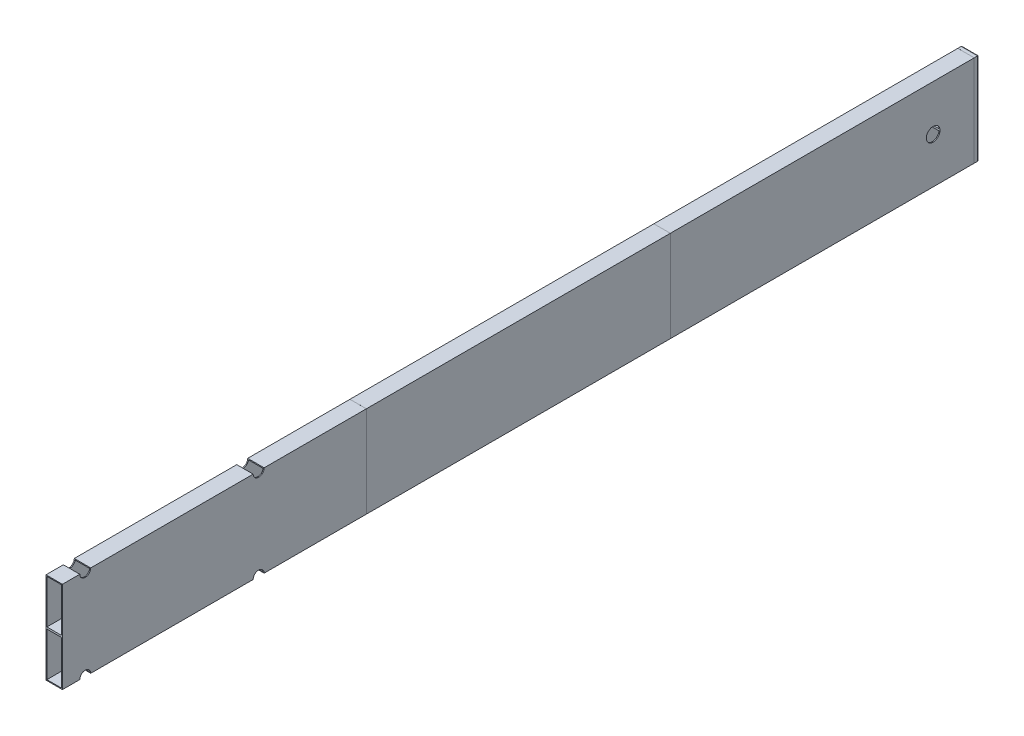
ISO-10303-21;
HEADER;
FILE_DESCRIPTION(('STEP AP214'),'2;1');
FILE_NAME('part.step','',(''),(''),'','','');
FILE_SCHEMA(('AUTOMOTIVE_DESIGN { 1 0 10303 214 1 1 1 1 }'));
ENDSEC;
DATA;
#1=APPLICATION_CONTEXT('core data for automotive mechanical design processes');
#2=APPLICATION_PROTOCOL_DEFINITION('international standard','automotive_design',2000,#1);
#3=PRODUCT_CONTEXT('',#1,'mechanical');
#4=PRODUCT('Part','Part','',(#3));
#5=PRODUCT_RELATED_PRODUCT_CATEGORY('part','',(#4));
#6=PRODUCT_DEFINITION_FORMATION('','',#4);
#7=PRODUCT_DEFINITION_CONTEXT('part definition',#1,'design');
#8=PRODUCT_DEFINITION('design','',#6,#7);
#9=PRODUCT_DEFINITION_SHAPE('','',#8);
#10=(LENGTH_UNIT() NAMED_UNIT(*) SI_UNIT(.MILLI.,.METRE.));
#11=(NAMED_UNIT(*) PLANE_ANGLE_UNIT() SI_UNIT($,.RADIAN.));
#12=(NAMED_UNIT(*) SI_UNIT($,.STERADIAN.) SOLID_ANGLE_UNIT());
#13=UNCERTAINTY_MEASURE_WITH_UNIT(LENGTH_MEASURE(1.E-05),#10,'distance_accuracy_value','');
#14=(GEOMETRIC_REPRESENTATION_CONTEXT(3) GLOBAL_UNCERTAINTY_ASSIGNED_CONTEXT((#13)) GLOBAL_UNIT_ASSIGNED_CONTEXT((#10,
#11,#12)) REPRESENTATION_CONTEXT('',''));
#15=CARTESIAN_POINT('',(0.,0.,0.));
#16=DIRECTION('',(0.,0.,1.));
#17=DIRECTION('',(1.,0.,0.));
#18=AXIS2_PLACEMENT_3D('',#15,#16,#17);
#19=CARTESIAN_POINT('',(-8.00000000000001,51.,-333.));
#20=DIRECTION('',(0.,-1.,0.));
#21=DIRECTION('',(0.,0.,-1.));
#22=AXIS2_PLACEMENT_3D('',#19,#20,#21);
#23=PLANE('',#22);
#24=DIRECTION('',(0.,0.,1.));
#25=VECTOR('',#24,1.);
#26=CARTESIAN_POINT('',(-8.00000000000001,51.,-333.));
#27=LINE('',#26,#25);
#28=CARTESIAN_POINT('',(-8.,51.,-999.));
#29=VERTEX_POINT('',#28);
#30=CARTESIAN_POINT('',(-8.00000000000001,51.,-961.433034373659));
#31=VERTEX_POINT('',#30);
#32=EDGE_CURVE('E399',#29,#31,#27,.T.);
#33=ORIENTED_EDGE('',*,*,#32,.T.);
#34=DIRECTION('',(1.,0.,0.));
#35=VECTOR('',#34,1.);
#36=CARTESIAN_POINT('',(-9.01000000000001,51.,-961.433034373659));
#37=LINE('',#36,#35);
#38=CARTESIAN_POINT('',(8.00000000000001,51.,-961.433034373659));
#39=VERTEX_POINT('',#38);
#40=EDGE_CURVE('E508',#31,#39,#37,.T.);
#41=ORIENTED_EDGE('',*,*,#40,.T.);
#42=DIRECTION('',(0.,0.,1.));
#43=VECTOR('',#42,1.);
#44=CARTESIAN_POINT('',(8.00000000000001,51.,-333.));
#45=LINE('',#44,#43);
#46=CARTESIAN_POINT('',(8.,51.,-999.));
#47=VERTEX_POINT('',#46);
#48=EDGE_CURVE('E394',#47,#39,#45,.T.);
#49=ORIENTED_EDGE('',*,*,#48,.F.);
#50=DIRECTION('',(-1.,0.,0.));
#51=VECTOR('',#50,1.);
#52=CARTESIAN_POINT('',(8.,51.,-999.));
#53=LINE('',#52,#51);
#54=EDGE_CURVE('E548',#47,#29,#53,.T.);
#55=ORIENTED_EDGE('',*,*,#54,.T.);
#56=EDGE_LOOP('',(#33,#41,#49,#55));
#57=FACE_BOUND('',#56,.T.);
#58=ADVANCED_FACE('F39',(#57),#23,.F.);
#59=CARTESIAN_POINT('',(-8.00000000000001,49.,-333.));
#60=DIRECTION('',(0.,1.,0.));
#61=DIRECTION('',(0.,0.,1.));
#62=AXIS2_PLACEMENT_3D('',#59,#60,#61);
#63=PLANE('',#62);
#64=DIRECTION('',(0.,0.,1.));
#65=VECTOR('',#64,1.);
#66=CARTESIAN_POINT('',(-8.00000000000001,49.,-333.));
#67=LINE('',#66,#65);
#68=CARTESIAN_POINT('',(-8.00000000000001,49.,-946.566965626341));
#69=VERTEX_POINT('',#68);
#70=CARTESIAN_POINT('',(-8.00000000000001,49.,0.));
#71=VERTEX_POINT('',#70);
#72=EDGE_CURVE('E347',#69,#71,#67,.T.);
#73=ORIENTED_EDGE('',*,*,#72,.F.);
#74=DIRECTION('',(1.,0.,0.));
#75=VECTOR('',#74,1.);
#76=CARTESIAN_POINT('',(-9.01000000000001,49.,-946.566965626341));
#77=LINE('',#76,#75);
#78=CARTESIAN_POINT('',(8.00000000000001,49.,-946.566965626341));
#79=VERTEX_POINT('',#78);
#80=EDGE_CURVE('E334',#69,#79,#77,.T.);
#81=ORIENTED_EDGE('',*,*,#80,.T.);
#82=DIRECTION('',(0.,0.,1.));
#83=VECTOR('',#82,1.);
#84=CARTESIAN_POINT('',(8.00000000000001,49.,-333.));
#85=LINE('',#84,#83);
#86=CARTESIAN_POINT('',(8.00000000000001,49.,0.));
#87=VERTEX_POINT('',#86);
#88=EDGE_CURVE('E345',#79,#87,#85,.T.);
#89=ORIENTED_EDGE('',*,*,#88,.T.);
#90=DIRECTION('',(-1.,0.,0.));
#91=VECTOR('',#90,1.);
#92=CARTESIAN_POINT('',(-8.00000000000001,49.,0.));
#93=LINE('',#92,#91);
#94=EDGE_CURVE('E697',#87,#71,#93,.T.);
#95=ORIENTED_EDGE('',*,*,#94,.T.);
#96=EDGE_LOOP('',(#73,#81,#89,#95));
#97=FACE_BOUND('',#96,.T.);
#98=ADVANCED_FACE('F343',(#97),#63,.F.);
#99=CARTESIAN_POINT('',(9.01,-0.00999999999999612,-666.));
#100=DIRECTION('',(0.,0.,-1.));
#101=DIRECTION('',(-1.,0.,0.));
#102=AXIS2_PLACEMENT_3D('',#99,#100,#101);
#103=PLANE('',#102);
#104=DIRECTION('',(0.,-1.,0.));
#105=VECTOR('',#104,1.);
#106=CARTESIAN_POINT('',(9.01,100.01,-666.));
#107=LINE('',#106,#105);
#108=CARTESIAN_POINT('',(9.01,100.01,-666.));
#109=VERTEX_POINT('',#108);
#110=CARTESIAN_POINT('',(9.01,-0.00999999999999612,-666.));
#111=VERTEX_POINT('',#110);
#112=EDGE_CURVE('E598',#109,#111,#107,.T.);
#113=ORIENTED_EDGE('',*,*,#112,.T.);
#114=DIRECTION('',(-1.,0.,0.));
#115=VECTOR('',#114,1.);
#116=CARTESIAN_POINT('',(9.01,-0.00999999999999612,-666.));
#117=LINE('',#116,#115);
#118=CARTESIAN_POINT('',(-9.01,-0.00999999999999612,-666.));
#119=VERTEX_POINT('',#118);
#120=EDGE_CURVE('E601',#111,#119,#117,.T.);
#121=ORIENTED_EDGE('',*,*,#120,.T.);
#122=DIRECTION('',(0.,1.,0.));
#123=VECTOR('',#122,1.);
#124=CARTESIAN_POINT('',(-9.01,100.01,-666.));
#125=LINE('',#124,#123);
#126=CARTESIAN_POINT('',(-9.01,100.01,-666.));
#127=VERTEX_POINT('',#126);
#128=EDGE_CURVE('E603',#119,#127,#125,.T.);
#129=ORIENTED_EDGE('',*,*,#128,.T.);
#130=DIRECTION('',(1.,0.,0.));
#131=VECTOR('',#130,1.);
#132=CARTESIAN_POINT('',(9.01,100.01,-666.));
#133=LINE('',#132,#131);
#134=EDGE_CURVE('E605',#127,#109,#133,.T.);
#135=ORIENTED_EDGE('',*,*,#134,.T.);
#136=EDGE_LOOP('',(#113,#121,#129,#135));
#137=FACE_BOUND('',#136,.T.);
#138=DIRECTION('',(-1.,0.,0.));
#139=VECTOR('',#138,1.);
#140=CARTESIAN_POINT('',(9.,0.,-666.));
#141=LINE('',#140,#139);
#142=CARTESIAN_POINT('',(9.,0.,-666.));
#143=VERTEX_POINT('',#142);
#144=CARTESIAN_POINT('',(-9.,0.,-666.));
#145=VERTEX_POINT('',#144);
#146=EDGE_CURVE('E560',#143,#145,#141,.T.);
#147=ORIENTED_EDGE('',*,*,#146,.F.);
#148=DIRECTION('',(0.,-1.,0.));
#149=VECTOR('',#148,1.);
#150=CARTESIAN_POINT('',(9.,100.,-666.));
#151=LINE('',#150,#149);
#152=CARTESIAN_POINT('',(9.,100.,-666.));
#153=VERTEX_POINT('',#152);
#154=EDGE_CURVE('E557',#153,#143,#151,.T.);
#155=ORIENTED_EDGE('',*,*,#154,.F.);
#156=DIRECTION('',(1.,0.,0.));
#157=VECTOR('',#156,1.);
#158=CARTESIAN_POINT('',(9.,100.,-666.));
#159=LINE('',#158,#157);
#160=CARTESIAN_POINT('',(-9.,100.,-666.));
#161=VERTEX_POINT('',#160);
#162=EDGE_CURVE('E565',#161,#153,#159,.T.);
#163=ORIENTED_EDGE('',*,*,#162,.F.);
#164=DIRECTION('',(0.,1.,0.));
#165=VECTOR('',#164,1.);
#166=CARTESIAN_POINT('',(-9.,100.,-666.));
#167=LINE('',#166,#165);
#168=EDGE_CURVE('E562',#145,#161,#167,.T.);
#169=ORIENTED_EDGE('',*,*,#168,.F.);
#170=EDGE_LOOP('',(#147,#155,#163,#169));
#171=FACE_BOUND('',#170,.T.);
#172=ADVANCED_FACE('F793',(#137,#171),#103,.T.);
#173=CARTESIAN_POINT('',(-9.,0.,-333.));
#174=DIRECTION('',(0.,-1.,0.));
#175=DIRECTION('',(0.,0.,-1.));
#176=AXIS2_PLACEMENT_3D('',#173,#174,#175);
#177=PLANE('',#176);
#178=DIRECTION('',(1.,0.,0.));
#179=VECTOR('',#178,1.);
#180=CARTESIAN_POINT('',(-9.00000000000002,0.,-221.));
#181=LINE('',#180,#179);
#182=CARTESIAN_POINT('',(-9.00000000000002,0.,-221.));
#183=VERTEX_POINT('',#182);
#184=CARTESIAN_POINT('',(9.,0.,-221.));
#185=VERTEX_POINT('',#184);
#186=EDGE_CURVE('E635',#183,#185,#181,.T.);
#187=ORIENTED_EDGE('',*,*,#186,.F.);
#188=DIRECTION('',(0.,0.,1.));
#189=VECTOR('',#188,1.);
#190=CARTESIAN_POINT('',(-9.,0.,-333.));
#191=LINE('',#190,#189);
#192=CARTESIAN_POINT('',(-9.,0.,-333.));
#193=VERTEX_POINT('',#192);
#194=EDGE_CURVE('E442',#193,#183,#191,.T.);
#195=ORIENTED_EDGE('',*,*,#194,.F.);
#196=DIRECTION('',(1.,0.,0.));
#197=VECTOR('',#196,1.);
#198=CARTESIAN_POINT('',(-9.,0.,-333.));
#199=LINE('',#198,#197);
#200=CARTESIAN_POINT('',(9.,0.,-333.));
#201=VERTEX_POINT('',#200);
#202=EDGE_CURVE('E416',#193,#201,#199,.T.);
#203=ORIENTED_EDGE('',*,*,#202,.T.);
#204=DIRECTION('',(0.,0.,1.));
#205=VECTOR('',#204,1.);
#206=CARTESIAN_POINT('',(9.,0.,-333.));
#207=LINE('',#206,#205);
#208=EDGE_CURVE('E437',#201,#185,#207,.T.);
#209=ORIENTED_EDGE('',*,*,#208,.T.);
#210=EDGE_LOOP('',(#187,#195,#203,#209));
#211=FACE_BOUND('',#210,.T.);
#212=ADVANCED_FACE('F865',(#211),#177,.T.);
#213=CARTESIAN_POINT('',(-8.,1.,-333.));
#214=DIRECTION('',(0.,-1.,0.));
#215=DIRECTION('',(0.,0.,-1.));
#216=AXIS2_PLACEMENT_3D('',#213,#214,#215);
#217=PLANE('',#216);
#218=DIRECTION('',(0.,0.,1.));
#219=VECTOR('',#218,1.);
#220=CARTESIAN_POINT('',(-8.,1.,-333.));
#221=LINE('',#220,#219);
#222=CARTESIAN_POINT('',(-8.,1.,-999.));
#223=VERTEX_POINT('',#222);
#224=CARTESIAN_POINT('',(-8.,1.,-220.9160797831));
#225=VERTEX_POINT('',#224);
#226=EDGE_CURVE('E365',#223,#225,#221,.T.);
#227=ORIENTED_EDGE('',*,*,#226,.T.);
#228=DIRECTION('',(1.,0.,0.));
#229=VECTOR('',#228,1.);
#230=CARTESIAN_POINT('',(-9.00000000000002,1.,-220.9160797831));
#231=LINE('',#230,#229);
#232=CARTESIAN_POINT('',(8.,1.,-220.9160797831));
#233=VERTEX_POINT('',#232);
#234=EDGE_CURVE('E627',#225,#233,#231,.T.);
#235=ORIENTED_EDGE('',*,*,#234,.T.);
#236=DIRECTION('',(0.,0.,1.));
#237=VECTOR('',#236,1.);
#238=CARTESIAN_POINT('',(8.,1.,-333.));
#239=LINE('',#238,#237);
#240=CARTESIAN_POINT('',(8.,1.,-999.));
#241=VERTEX_POINT('',#240);
#242=EDGE_CURVE('E355',#241,#233,#239,.T.);
#243=ORIENTED_EDGE('',*,*,#242,.F.);
#244=DIRECTION('',(-1.,0.,0.));
#245=VECTOR('',#244,1.);
#246=CARTESIAN_POINT('',(8.,1.,-999.));
#247=LINE('',#246,#245);
#248=EDGE_CURVE('E536',#241,#223,#247,.T.);
#249=ORIENTED_EDGE('',*,*,#248,.T.);
#250=EDGE_LOOP('',(#227,#235,#243,#249));
#251=FACE_BOUND('',#250,.T.);
#252=ADVANCED_FACE('F722',(#251),#217,.F.);
#253=DIRECTION('',(1.,0.,0.));
#254=VECTOR('',#253,1.);
#255=CARTESIAN_POINT('',(-9.00000000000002,0.,-209.));
#256=LINE('',#255,#254);
#257=CARTESIAN_POINT('',(9.,0.,-209.));
#258=VERTEX_POINT('',#257);
#259=CARTESIAN_POINT('',(-9.00000000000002,0.,-209.));
#260=VERTEX_POINT('',#259);
#261=EDGE_CURVE('E633',#258,#260,#256,.F.);
#262=ORIENTED_EDGE('',*,*,#261,.F.);
#263=CARTESIAN_POINT('',(9.,0.,-31.));
#264=VERTEX_POINT('',#263);
#265=EDGE_CURVE('E440',#258,#264,#207,.T.);
#266=ORIENTED_EDGE('',*,*,#265,.T.);
#267=DIRECTION('',(1.,0.,0.));
#268=VECTOR('',#267,1.);
#269=CARTESIAN_POINT('',(-9.00000000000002,0.,-31.));
#270=LINE('',#269,#268);
#271=CARTESIAN_POINT('',(-9.00000000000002,0.,-31.));
#272=VERTEX_POINT('',#271);
#273=EDGE_CURVE('E650',#272,#264,#270,.T.);
#274=ORIENTED_EDGE('',*,*,#273,.F.);
#275=EDGE_CURVE('E445',#260,#272,#191,.T.);
#276=ORIENTED_EDGE('',*,*,#275,.F.);
#277=EDGE_LOOP('',(#262,#266,#274,#276));
#278=FACE_BOUND('',#277,.T.);
#279=ADVANCED_FACE('F900',(#278),#177,.T.);
#280=CARTESIAN_POINT('',(8.,1.,-209.0839202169));
#281=VERTEX_POINT('',#280);
#282=CARTESIAN_POINT('',(8.,1.,-30.9160797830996));
#283=VERTEX_POINT('',#282);
#284=EDGE_CURVE('E358',#281,#283,#239,.T.);
#285=ORIENTED_EDGE('',*,*,#284,.F.);
#286=DIRECTION('',(1.,0.,0.));
#287=VECTOR('',#286,1.);
#288=CARTESIAN_POINT('',(-9.00000000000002,1.,-209.0839202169));
#289=LINE('',#288,#287);
#290=CARTESIAN_POINT('',(-8.,1.,-209.0839202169));
#291=VERTEX_POINT('',#290);
#292=EDGE_CURVE('E624',#281,#291,#289,.F.);
#293=ORIENTED_EDGE('',*,*,#292,.T.);
#294=CARTESIAN_POINT('',(-8.,1.,-30.9160797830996));
#295=VERTEX_POINT('',#294);
#296=EDGE_CURVE('E368',#291,#295,#221,.T.);
#297=ORIENTED_EDGE('',*,*,#296,.T.);
#298=DIRECTION('',(1.,0.,0.));
#299=VECTOR('',#298,1.);
#300=CARTESIAN_POINT('',(-9.00000000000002,1.,-30.9160797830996));
#301=LINE('',#300,#299);
#302=EDGE_CURVE('E454',#295,#283,#301,.T.);
#303=ORIENTED_EDGE('',*,*,#302,.T.);
#304=EDGE_LOOP('',(#285,#293,#297,#303));
#305=FACE_BOUND('',#304,.T.);
#306=ADVANCED_FACE('F705',(#305),#217,.F.);
#307=CARTESIAN_POINT('',(-9.00000000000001,100.,-333.));
#308=DIRECTION('',(0.,1.,0.));
#309=DIRECTION('',(0.,0.,1.));
#310=AXIS2_PLACEMENT_3D('',#307,#308,#309);
#311=PLANE('',#310);
#312=DIRECTION('',(1.,0.,0.));
#313=VECTOR('',#312,1.);
#314=CARTESIAN_POINT('',(-9.00000000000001,100.,-209.));
#315=LINE('',#314,#313);
#316=CARTESIAN_POINT('',(-9.00000000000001,100.,-209.));
#317=VERTEX_POINT('',#316);
#318=CARTESIAN_POINT('',(9.00000000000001,100.,-209.));
#319=VERTEX_POINT('',#318);
#320=EDGE_CURVE('E669',#317,#319,#315,.T.);
#321=ORIENTED_EDGE('',*,*,#320,.F.);
#322=DIRECTION('',(0.,0.,1.));
#323=VECTOR('',#322,1.);
#324=CARTESIAN_POINT('',(-9.00000000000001,100.,-333.));
#325=LINE('',#324,#323);
#326=CARTESIAN_POINT('',(-9.00000000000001,100.,-31.));
#327=VERTEX_POINT('',#326);
#328=EDGE_CURVE('E430',#317,#327,#325,.T.);
#329=ORIENTED_EDGE('',*,*,#328,.T.);
#330=DIRECTION('',(1.,0.,0.));
#331=VECTOR('',#330,1.);
#332=CARTESIAN_POINT('',(-9.00000000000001,100.,-31.));
#333=LINE('',#332,#331);
#334=CARTESIAN_POINT('',(9.00000000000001,100.,-31.));
#335=VERTEX_POINT('',#334);
#336=EDGE_CURVE('E686',#335,#327,#333,.F.);
#337=ORIENTED_EDGE('',*,*,#336,.F.);
#338=DIRECTION('',(0.,0.,1.));
#339=VECTOR('',#338,1.);
#340=CARTESIAN_POINT('',(9.00000000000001,100.,-333.));
#341=LINE('',#340,#339);
#342=EDGE_CURVE('E435',#319,#335,#341,.T.);
#343=ORIENTED_EDGE('',*,*,#342,.F.);
#344=EDGE_LOOP('',(#321,#329,#337,#343));
#345=FACE_BOUND('',#344,.T.);
#346=ADVANCED_FACE('F773',(#345),#311,.T.);
#347=CARTESIAN_POINT('',(-8.,99.,-333.));
#348=DIRECTION('',(0.,1.,0.));
#349=DIRECTION('',(0.,0.,1.));
#350=AXIS2_PLACEMENT_3D('',#347,#348,#349);
#351=PLANE('',#350);
#352=DIRECTION('',(0.,0.,1.));
#353=VECTOR('',#352,1.);
#354=CARTESIAN_POINT('',(-8.,99.,-333.));
#355=LINE('',#354,#353);
#356=CARTESIAN_POINT('',(-8.,99.,-209.0839202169));
#357=VERTEX_POINT('',#356);
#358=CARTESIAN_POINT('',(-8.,99.,-30.9160797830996));
#359=VERTEX_POINT('',#358);
#360=EDGE_CURVE('E387',#357,#359,#355,.T.);
#361=ORIENTED_EDGE('',*,*,#360,.F.);
#362=DIRECTION('',(1.,0.,0.));
#363=VECTOR('',#362,1.);
#364=CARTESIAN_POINT('',(-9.00000000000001,99.,-209.0839202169));
#365=LINE('',#364,#363);
#366=CARTESIAN_POINT('',(8.,99.,-209.0839202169));
#367=VERTEX_POINT('',#366);
#368=EDGE_CURVE('E661',#357,#367,#365,.T.);
#369=ORIENTED_EDGE('',*,*,#368,.T.);
#370=DIRECTION('',(0.,0.,1.));
#371=VECTOR('',#370,1.);
#372=CARTESIAN_POINT('',(8.,99.,-333.));
#373=LINE('',#372,#371);
#374=CARTESIAN_POINT('',(8.,99.,-30.9160797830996));
#375=VERTEX_POINT('',#374);
#376=EDGE_CURVE('E392',#367,#375,#373,.T.);
#377=ORIENTED_EDGE('',*,*,#376,.T.);
#378=DIRECTION('',(1.,0.,0.));
#379=VECTOR('',#378,1.);
#380=CARTESIAN_POINT('',(-9.00000000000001,99.,-30.9160797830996));
#381=LINE('',#380,#379);
#382=EDGE_CURVE('E677',#375,#359,#381,.F.);
#383=ORIENTED_EDGE('',*,*,#382,.T.);
#384=EDGE_LOOP('',(#361,#369,#377,#383));
#385=FACE_BOUND('',#384,.T.);
#386=ADVANCED_FACE('F770',(#385),#351,.F.);
#387=DIRECTION('',(1.,0.,0.));
#388=VECTOR('',#387,1.);
#389=CARTESIAN_POINT('',(-9.00000000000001,100.,-19.));
#390=LINE('',#389,#388);
#391=CARTESIAN_POINT('',(-9.00000000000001,100.,-19.));
#392=VERTEX_POINT('',#391);
#393=CARTESIAN_POINT('',(9.00000000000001,100.,-19.));
#394=VERTEX_POINT('',#393);
#395=EDGE_CURVE('E689',#392,#394,#390,.T.);
#396=ORIENTED_EDGE('',*,*,#395,.F.);
#397=CARTESIAN_POINT('',(-9.00000000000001,100.,0.));
#398=VERTEX_POINT('',#397);
#399=EDGE_CURVE('E431',#392,#398,#325,.T.);
#400=ORIENTED_EDGE('',*,*,#399,.T.);
#401=DIRECTION('',(-1.,0.,0.));
#402=VECTOR('',#401,1.);
#403=CARTESIAN_POINT('',(-9.00000000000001,100.,0.));
#404=LINE('',#403,#402);
#405=CARTESIAN_POINT('',(9.00000000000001,100.,0.));
#406=VERTEX_POINT('',#405);
#407=EDGE_CURVE('E410',#406,#398,#404,.T.);
#408=ORIENTED_EDGE('',*,*,#407,.F.);
#409=EDGE_CURVE('E436',#394,#406,#341,.T.);
#410=ORIENTED_EDGE('',*,*,#409,.F.);
#411=EDGE_LOOP('',(#396,#400,#408,#410));
#412=FACE_BOUND('',#411,.T.);
#413=ADVANCED_FACE('F772',(#412),#311,.T.);
#414=CARTESIAN_POINT('',(-8.,99.,-19.0839202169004));
#415=VERTEX_POINT('',#414);
#416=CARTESIAN_POINT('',(-8.,99.,0.));
#417=VERTEX_POINT('',#416);
#418=EDGE_CURVE('E388',#415,#417,#355,.T.);
#419=ORIENTED_EDGE('',*,*,#418,.F.);
#420=DIRECTION('',(1.,0.,0.));
#421=VECTOR('',#420,1.);
#422=CARTESIAN_POINT('',(-9.00000000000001,99.,-19.0839202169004));
#423=LINE('',#422,#421);
#424=CARTESIAN_POINT('',(8.,99.,-19.0839202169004));
#425=VERTEX_POINT('',#424);
#426=EDGE_CURVE('E680',#415,#425,#423,.T.);
#427=ORIENTED_EDGE('',*,*,#426,.T.);
#428=CARTESIAN_POINT('',(8.,99.,0.));
#429=VERTEX_POINT('',#428);
#430=EDGE_CURVE('E393',#425,#429,#373,.T.);
#431=ORIENTED_EDGE('',*,*,#430,.T.);
#432=DIRECTION('',(-1.,0.,0.));
#433=VECTOR('',#432,1.);
#434=CARTESIAN_POINT('',(-8.,99.,0.));
#435=LINE('',#434,#433);
#436=EDGE_CURVE('E379',#429,#417,#435,.T.);
#437=ORIENTED_EDGE('',*,*,#436,.T.);
#438=EDGE_LOOP('',(#419,#427,#431,#437));
#439=FACE_BOUND('',#438,.T.);
#440=ADVANCED_FACE('F760',(#439),#351,.F.);
#441=CARTESIAN_POINT('',(-9.00000000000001,100.,-333.));
#442=DIRECTION('',(-1.,0.,0.));
#443=DIRECTION('',(0.,-1.,0.));
#444=AXIS2_PLACEMENT_3D('',#441,#442,#443);
#445=PLANE('',#444);
#446=CARTESIAN_POINT('',(-9.00000000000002,0.,-215.));
#447=DIRECTION('',(1.,0.,0.));
#448=DIRECTION('',(0.,1.,0.));
#449=AXIS2_PLACEMENT_3D('',#446,#447,#448);
#450=CIRCLE('',#449,6.00000000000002);
#451=EDGE_CURVE('E621',#183,#260,#450,.T.);
#452=ORIENTED_EDGE('',*,*,#451,.T.);
#453=ORIENTED_EDGE('',*,*,#275,.T.);
#454=CARTESIAN_POINT('',(-9.00000000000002,0.,-25.));
#455=DIRECTION('',(1.,0.,0.));
#456=DIRECTION('',(0.,1.,0.));
#457=AXIS2_PLACEMENT_3D('',#454,#455,#456);
#458=CIRCLE('',#457,6.);
#459=CARTESIAN_POINT('',(-9.00000000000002,0.,-19.));
#460=VERTEX_POINT('',#459);
#461=EDGE_CURVE('E639',#272,#460,#458,.T.);
#462=ORIENTED_EDGE('',*,*,#461,.T.);
#463=CARTESIAN_POINT('',(-9.,0.,0.));
#464=VERTEX_POINT('',#463);
#465=EDGE_CURVE('E425',#460,#464,#191,.T.);
#466=ORIENTED_EDGE('',*,*,#465,.T.);
#467=DIRECTION('',(0.,-1.,0.));
#468=VECTOR('',#467,1.);
#469=CARTESIAN_POINT('',(-9.00000000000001,100.,0.));
#470=LINE('',#469,#468);
#471=EDGE_CURVE('E386',#398,#464,#470,.T.);
#472=ORIENTED_EDGE('',*,*,#471,.F.);
#473=ORIENTED_EDGE('',*,*,#399,.F.);
#474=CARTESIAN_POINT('',(-9.00000000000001,100.,-25.));
#475=DIRECTION('',(1.,0.,0.));
#476=DIRECTION('',(0.,1.,0.));
#477=AXIS2_PLACEMENT_3D('',#474,#475,#476);
#478=CIRCLE('',#477,6.00000000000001);
#479=EDGE_CURVE('E674',#392,#327,#478,.T.);
#480=ORIENTED_EDGE('',*,*,#479,.T.);
#481=ORIENTED_EDGE('',*,*,#328,.F.);
#482=CARTESIAN_POINT('',(-9.00000000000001,100.,-215.));
#483=DIRECTION('',(1.,0.,0.));
#484=DIRECTION('',(0.,1.,0.));
#485=AXIS2_PLACEMENT_3D('',#482,#483,#484);
#486=CIRCLE('',#485,6.00000000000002);
#487=CARTESIAN_POINT('',(-9.00000000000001,100.,-221.));
#488=VERTEX_POINT('',#487);
#489=EDGE_CURVE('E655',#317,#488,#486,.T.);
#490=ORIENTED_EDGE('',*,*,#489,.T.);
#491=CARTESIAN_POINT('',(-9.00000000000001,100.,-333.));
#492=VERTEX_POINT('',#491);
#493=EDGE_CURVE('E426',#492,#488,#325,.T.);
#494=ORIENTED_EDGE('',*,*,#493,.F.);
#495=DIRECTION('',(0.,-1.,0.));
#496=VECTOR('',#495,1.);
#497=CARTESIAN_POINT('',(-9.00000000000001,100.,-333.));
#498=LINE('',#497,#496);
#499=EDGE_CURVE('E413',#492,#193,#498,.T.);
#500=ORIENTED_EDGE('',*,*,#499,.T.);
#501=ORIENTED_EDGE('',*,*,#194,.T.);
#502=EDGE_LOOP('',(#452,#453,#462,#466,#472,#473,#480,#481,#490,#494,#500,#501));
#503=FACE_BOUND('',#502,.T.);
#504=ADVANCED_FACE('F41',(#503),#445,.T.);
#505=DIRECTION('',(1.,0.,0.));
#506=VECTOR('',#505,1.);
#507=CARTESIAN_POINT('',(-9.00000000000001,100.,-221.));
#508=LINE('',#507,#506);
#509=CARTESIAN_POINT('',(9.00000000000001,100.,-221.));
#510=VERTEX_POINT('',#509);
#511=EDGE_CURVE('E667',#510,#488,#508,.F.);
#512=ORIENTED_EDGE('',*,*,#511,.F.);
#513=CARTESIAN_POINT('',(9.00000000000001,100.,-333.));
#514=VERTEX_POINT('',#513);
#515=EDGE_CURVE('E432',#514,#510,#341,.T.);
#516=ORIENTED_EDGE('',*,*,#515,.F.);
#517=DIRECTION('',(-1.,0.,0.));
#518=VECTOR('',#517,1.);
#519=CARTESIAN_POINT('',(-9.00000000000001,100.,-333.));
#520=LINE('',#519,#518);
#521=EDGE_CURVE('E422',#514,#492,#520,.T.);
#522=ORIENTED_EDGE('',*,*,#521,.T.);
#523=ORIENTED_EDGE('',*,*,#493,.T.);
#524=EDGE_LOOP('',(#512,#516,#522,#523));
#525=FACE_BOUND('',#524,.T.);
#526=ADVANCED_FACE('F781',(#525),#311,.T.);
#527=CARTESIAN_POINT('',(9.00000000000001,100.,-333.));
#528=DIRECTION('',(1.,0.,0.));
#529=DIRECTION('',(0.,1.,0.));
#530=AXIS2_PLACEMENT_3D('',#527,#528,#529);
#531=PLANE('',#530);
#532=CARTESIAN_POINT('',(9.,0.,-215.));
#533=DIRECTION('',(1.,0.,0.));
#534=DIRECTION('',(0.,1.,0.));
#535=AXIS2_PLACEMENT_3D('',#532,#533,#534);
#536=CIRCLE('',#535,6.00000000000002);
#537=EDGE_CURVE('E619',#185,#258,#536,.T.);
#538=ORIENTED_EDGE('',*,*,#537,.F.);
#539=ORIENTED_EDGE('',*,*,#208,.F.);
#540=DIRECTION('',(0.,1.,0.));
#541=VECTOR('',#540,1.);
#542=CARTESIAN_POINT('',(9.00000000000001,100.,-333.));
#543=LINE('',#542,#541);
#544=EDGE_CURVE('E419',#201,#514,#543,.T.);
#545=ORIENTED_EDGE('',*,*,#544,.T.);
#546=ORIENTED_EDGE('',*,*,#515,.T.);
#547=CARTESIAN_POINT('',(9.00000000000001,100.,-215.));
#548=DIRECTION('',(1.,0.,0.));
#549=DIRECTION('',(0.,1.,0.));
#550=AXIS2_PLACEMENT_3D('',#547,#548,#549);
#551=CIRCLE('',#550,6.00000000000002);
#552=EDGE_CURVE('E653',#319,#510,#551,.T.);
#553=ORIENTED_EDGE('',*,*,#552,.F.);
#554=ORIENTED_EDGE('',*,*,#342,.T.);
#555=CARTESIAN_POINT('',(9.00000000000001,100.,-25.));
#556=DIRECTION('',(1.,0.,0.));
#557=DIRECTION('',(0.,1.,0.));
#558=AXIS2_PLACEMENT_3D('',#555,#556,#557);
#559=CIRCLE('',#558,6.00000000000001);
#560=EDGE_CURVE('E671',#394,#335,#559,.T.);
#561=ORIENTED_EDGE('',*,*,#560,.F.);
#562=ORIENTED_EDGE('',*,*,#409,.T.);
#563=DIRECTION('',(0.,1.,0.));
#564=VECTOR('',#563,1.);
#565=CARTESIAN_POINT('',(9.00000000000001,100.,0.));
#566=LINE('',#565,#564);
#567=CARTESIAN_POINT('',(9.,0.,0.));
#568=VERTEX_POINT('',#567);
#569=EDGE_CURVE('E407',#568,#406,#566,.T.);
#570=ORIENTED_EDGE('',*,*,#569,.F.);
#571=CARTESIAN_POINT('',(9.,0.,-19.));
#572=VERTEX_POINT('',#571);
#573=EDGE_CURVE('E441',#572,#568,#207,.T.);
#574=ORIENTED_EDGE('',*,*,#573,.F.);
#575=CARTESIAN_POINT('',(9.,0.,-25.));
#576=DIRECTION('',(1.,0.,0.));
#577=DIRECTION('',(0.,1.,0.));
#578=AXIS2_PLACEMENT_3D('',#575,#576,#577);
#579=CIRCLE('',#578,6.);
#580=EDGE_CURVE('E637',#264,#572,#579,.T.);
#581=ORIENTED_EDGE('',*,*,#580,.F.);
#582=ORIENTED_EDGE('',*,*,#265,.F.);
#583=EDGE_LOOP('',(#538,#539,#545,#546,#553,#554,#561,#562,#570,#574,#581,#582));
#584=FACE_BOUND('',#583,.T.);
#585=ADVANCED_FACE('F912',(#584),#531,.T.);
#586=DIRECTION('',(1.,0.,0.));
#587=VECTOR('',#586,1.);
#588=CARTESIAN_POINT('',(-9.00000000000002,0.,-19.));
#589=LINE('',#588,#587);
#590=EDGE_CURVE('E648',#572,#460,#589,.F.);
#591=ORIENTED_EDGE('',*,*,#590,.F.);
#592=ORIENTED_EDGE('',*,*,#573,.T.);
#593=DIRECTION('',(1.,0.,0.));
#594=VECTOR('',#593,1.);
#595=CARTESIAN_POINT('',(-9.,0.,0.));
#596=LINE('',#595,#594);
#597=EDGE_CURVE('E404',#464,#568,#596,.T.);
#598=ORIENTED_EDGE('',*,*,#597,.F.);
#599=ORIENTED_EDGE('',*,*,#465,.F.);
#600=EDGE_LOOP('',(#591,#592,#598,#599));
#601=FACE_BOUND('',#600,.T.);
#602=ADVANCED_FACE('F906',(#601),#177,.T.);
#603=CARTESIAN_POINT('',(-9.,0.,0.));
#604=DIRECTION('',(0.,0.,1.));
#605=DIRECTION('',(1.,0.,0.));
#606=AXIS2_PLACEMENT_3D('',#603,#604,#605);
#607=PLANE('',#606);
#608=DIRECTION('',(0.,-1.,0.));
#609=VECTOR('',#608,1.);
#610=CARTESIAN_POINT('',(-8.,1.,0.));
#611=LINE('',#610,#609);
#612=CARTESIAN_POINT('',(-8.,1.,0.));
#613=VERTEX_POINT('',#612);
#614=EDGE_CURVE('E691',#71,#613,#611,.T.);
#615=ORIENTED_EDGE('',*,*,#614,.F.);
#616=ORIENTED_EDGE('',*,*,#94,.F.);
#617=DIRECTION('',(0.,1.,0.));
#618=VECTOR('',#617,1.);
#619=CARTESIAN_POINT('',(8.,1.,0.));
#620=LINE('',#619,#618);
#621=CARTESIAN_POINT('',(8.,1.,0.));
#622=VERTEX_POINT('',#621);
#623=EDGE_CURVE('E352',#622,#87,#620,.T.);
#624=ORIENTED_EDGE('',*,*,#623,.F.);
#625=DIRECTION('',(1.,0.,0.));
#626=VECTOR('',#625,1.);
#627=CARTESIAN_POINT('',(-8.,1.,0.));
#628=LINE('',#627,#626);
#629=EDGE_CURVE('E694',#613,#622,#628,.T.);
#630=ORIENTED_EDGE('',*,*,#629,.F.);
#631=EDGE_LOOP('',(#615,#616,#624,#630));
#632=FACE_BOUND('',#631,.T.);
#633=DIRECTION('',(0.,-1.,0.));
#634=VECTOR('',#633,1.);
#635=CARTESIAN_POINT('',(-8.,99.,0.));
#636=LINE('',#635,#634);
#637=CARTESIAN_POINT('',(-8.00000000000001,51.,0.));
#638=VERTEX_POINT('',#637);
#639=EDGE_CURVE('E370',#417,#638,#636,.T.);
#640=ORIENTED_EDGE('',*,*,#639,.F.);
#641=ORIENTED_EDGE('',*,*,#436,.F.);
#642=DIRECTION('',(0.,1.,0.));
#643=VECTOR('',#642,1.);
#644=CARTESIAN_POINT('',(8.,99.,0.));
#645=LINE('',#644,#643);
#646=CARTESIAN_POINT('',(8.00000000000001,51.,0.));
#647=VERTEX_POINT('',#646);
#648=EDGE_CURVE('E376',#647,#429,#645,.T.);
#649=ORIENTED_EDGE('',*,*,#648,.F.);
#650=DIRECTION('',(1.,0.,0.));
#651=VECTOR('',#650,1.);
#652=CARTESIAN_POINT('',(-8.00000000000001,51.,0.));
#653=LINE('',#652,#651);
#654=EDGE_CURVE('E373',#638,#647,#653,.T.);
#655=ORIENTED_EDGE('',*,*,#654,.F.);
#656=EDGE_LOOP('',(#640,#641,#649,#655));
#657=FACE_BOUND('',#656,.T.);
#658=ORIENTED_EDGE('',*,*,#471,.T.);
#659=ORIENTED_EDGE('',*,*,#597,.T.);
#660=ORIENTED_EDGE('',*,*,#569,.T.);
#661=ORIENTED_EDGE('',*,*,#407,.T.);
#662=EDGE_LOOP('',(#658,#659,#660,#661));
#663=FACE_BOUND('',#662,.T.);
#664=ADVANCED_FACE('F714',(#632,#657,#663),#607,.T.);
#665=CARTESIAN_POINT('',(-8.,99.,-333.));
#666=DIRECTION('',(-1.,0.,0.));
#667=DIRECTION('',(0.,-1.,0.));
#668=AXIS2_PLACEMENT_3D('',#665,#666,#667);
#669=PLANE('',#668);
#670=CARTESIAN_POINT('',(-8.00000000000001,51.,-946.566965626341));
#671=VERTEX_POINT('',#670);
#672=EDGE_CURVE('E382',#671,#638,#27,.T.);
#673=ORIENTED_EDGE('',*,*,#672,.F.);
#674=CARTESIAN_POINT('',(-8.00000000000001,50.,-954.));
#675=DIRECTION('',(-1.,0.,0.));
#676=DIRECTION('',(0.,-1.,0.));
#677=AXIS2_PLACEMENT_3D('',#674,#675,#676);
#678=CIRCLE('',#677,7.49999999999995);
#679=EDGE_CURVE('E55',#671,#31,#678,.T.);
#680=ORIENTED_EDGE('',*,*,#679,.T.);
#681=ORIENTED_EDGE('',*,*,#32,.F.);
#682=DIRECTION('',(0.,1.,0.));
#683=VECTOR('',#682,1.);
#684=CARTESIAN_POINT('',(-8.,51.,-999.));
#685=LINE('',#684,#683);
#686=CARTESIAN_POINT('',(-8.,99.,-999.));
#687=VERTEX_POINT('',#686);
#688=EDGE_CURVE('E551',#29,#687,#685,.T.);
#689=ORIENTED_EDGE('',*,*,#688,.T.);
#690=CARTESIAN_POINT('',(-8.,99.,-220.9160797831));
#691=VERTEX_POINT('',#690);
#692=EDGE_CURVE('E383',#687,#691,#355,.T.);
#693=ORIENTED_EDGE('',*,*,#692,.T.);
#694=CARTESIAN_POINT('',(-8.,100.,-215.));
#695=DIRECTION('',(-1.,0.,0.));
#696=DIRECTION('',(0.,-1.,0.));
#697=AXIS2_PLACEMENT_3D('',#694,#695,#696);
#698=CIRCLE('',#697,6.00000000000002);
#699=EDGE_CURVE('E664',#691,#357,#698,.T.);
#700=ORIENTED_EDGE('',*,*,#699,.T.);
#701=ORIENTED_EDGE('',*,*,#360,.T.);
#702=CARTESIAN_POINT('',(-8.,100.,-25.));
#703=DIRECTION('',(-1.,0.,0.));
#704=DIRECTION('',(0.,-1.,0.));
#705=AXIS2_PLACEMENT_3D('',#702,#703,#704);
#706=CIRCLE('',#705,6.00000000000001);
#707=EDGE_CURVE('E683',#359,#415,#706,.T.);
#708=ORIENTED_EDGE('',*,*,#707,.T.);
#709=ORIENTED_EDGE('',*,*,#418,.T.);
#710=ORIENTED_EDGE('',*,*,#639,.T.);
#711=EDGE_LOOP('',(#673,#680,#681,#689,#693,#700,#701,#708,#709,#710));
#712=FACE_BOUND('',#711,.T.);
#713=ADVANCED_FACE('F740',(#712),#669,.F.);
#714=CARTESIAN_POINT('',(8.,99.,-999.));
#715=VERTEX_POINT('',#714);
#716=CARTESIAN_POINT('',(8.,99.,-220.9160797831));
#717=VERTEX_POINT('',#716);
#718=EDGE_CURVE('E389',#715,#717,#373,.T.);
#719=ORIENTED_EDGE('',*,*,#718,.T.);
#720=DIRECTION('',(1.,0.,0.));
#721=VECTOR('',#720,1.);
#722=CARTESIAN_POINT('',(-9.00000000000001,99.,-220.9160797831));
#723=LINE('',#722,#721);
#724=EDGE_CURVE('E658',#717,#691,#723,.F.);
#725=ORIENTED_EDGE('',*,*,#724,.T.);
#726=ORIENTED_EDGE('',*,*,#692,.F.);
#727=DIRECTION('',(1.,0.,0.));
#728=VECTOR('',#727,1.);
#729=CARTESIAN_POINT('',(8.,99.,-999.));
#730=LINE('',#729,#728);
#731=EDGE_CURVE('E554',#687,#715,#730,.T.);
#732=ORIENTED_EDGE('',*,*,#731,.T.);
#733=EDGE_LOOP('',(#719,#725,#726,#732));
#734=FACE_BOUND('',#733,.T.);
#735=ADVANCED_FACE('F749',(#734),#351,.F.);
#736=CARTESIAN_POINT('',(8.,99.,-333.));
#737=DIRECTION('',(1.,0.,0.));
#738=DIRECTION('',(0.,1.,0.));
#739=AXIS2_PLACEMENT_3D('',#736,#737,#738);
#740=PLANE('',#739);
#741=ORIENTED_EDGE('',*,*,#48,.T.);
#742=CARTESIAN_POINT('',(8.00000000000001,50.,-954.));
#743=DIRECTION('',(1.,0.,0.));
#744=DIRECTION('',(0.,1.,0.));
#745=AXIS2_PLACEMENT_3D('',#742,#743,#744);
#746=CIRCLE('',#745,7.49999999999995);
#747=CARTESIAN_POINT('',(8.00000000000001,51.,-946.566965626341));
#748=VERTEX_POINT('',#747);
#749=EDGE_CURVE('E735',#39,#748,#746,.T.);
#750=ORIENTED_EDGE('',*,*,#749,.T.);
#751=EDGE_CURVE('E398',#748,#647,#45,.T.);
#752=ORIENTED_EDGE('',*,*,#751,.T.);
#753=ORIENTED_EDGE('',*,*,#648,.T.);
#754=ORIENTED_EDGE('',*,*,#430,.F.);
#755=CARTESIAN_POINT('',(8.,100.,-25.));
#756=DIRECTION('',(1.,0.,0.));
#757=DIRECTION('',(0.,1.,0.));
#758=AXIS2_PLACEMENT_3D('',#755,#756,#757);
#759=CIRCLE('',#758,6.00000000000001);
#760=EDGE_CURVE('E429',#425,#375,#759,.T.);
#761=ORIENTED_EDGE('',*,*,#760,.T.);
#762=ORIENTED_EDGE('',*,*,#376,.F.);
#763=CARTESIAN_POINT('',(8.,100.,-215.));
#764=DIRECTION('',(1.,0.,0.));
#765=DIRECTION('',(0.,1.,0.));
#766=AXIS2_PLACEMENT_3D('',#763,#764,#765);
#767=CIRCLE('',#766,6.00000000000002);
#768=EDGE_CURVE('E448',#367,#717,#767,.T.);
#769=ORIENTED_EDGE('',*,*,#768,.T.);
#770=ORIENTED_EDGE('',*,*,#718,.F.);
#771=DIRECTION('',(0.,-1.,0.));
#772=VECTOR('',#771,1.);
#773=CARTESIAN_POINT('',(8.,51.,-999.));
#774=LINE('',#773,#772);
#775=EDGE_CURVE('E545',#715,#47,#774,.T.);
#776=ORIENTED_EDGE('',*,*,#775,.T.);
#777=EDGE_LOOP('',(#741,#750,#752,#753,#754,#761,#762,#769,#770,#776));
#778=FACE_BOUND('',#777,.T.);
#779=ADVANCED_FACE('F754',(#778),#740,.F.);
#780=ORIENTED_EDGE('',*,*,#751,.F.);
#781=DIRECTION('',(1.,0.,0.));
#782=VECTOR('',#781,1.);
#783=CARTESIAN_POINT('',(-9.01000000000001,51.,-946.566965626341));
#784=LINE('',#783,#782);
#785=EDGE_CURVE('E733',#748,#671,#784,.F.);
#786=ORIENTED_EDGE('',*,*,#785,.T.);
#787=ORIENTED_EDGE('',*,*,#672,.T.);
#788=ORIENTED_EDGE('',*,*,#654,.T.);
#789=EDGE_LOOP('',(#780,#786,#787,#788));
#790=FACE_BOUND('',#789,.T.);
#791=ADVANCED_FACE('F789',(#790),#23,.F.);
#792=CARTESIAN_POINT('',(-8.,1.,-333.));
#793=DIRECTION('',(-1.,0.,0.));
#794=DIRECTION('',(0.,-1.,0.));
#795=AXIS2_PLACEMENT_3D('',#792,#793,#794);
#796=PLANE('',#795);
#797=CARTESIAN_POINT('',(-8.00000000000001,49.,-999.));
#798=VERTEX_POINT('',#797);
#799=CARTESIAN_POINT('',(-8.00000000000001,49.,-961.433034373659));
#800=VERTEX_POINT('',#799);
#801=EDGE_CURVE('E362',#798,#800,#67,.T.);
#802=ORIENTED_EDGE('',*,*,#801,.T.);
#803=CARTESIAN_POINT('',(-8.00000000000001,50.,-954.));
#804=DIRECTION('',(-1.,0.,0.));
#805=DIRECTION('',(0.,-1.,0.));
#806=AXIS2_PLACEMENT_3D('',#803,#804,#805);
#807=CIRCLE('',#806,7.49999999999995);
#808=EDGE_CURVE('E348',#800,#69,#807,.T.);
#809=ORIENTED_EDGE('',*,*,#808,.T.);
#810=ORIENTED_EDGE('',*,*,#72,.T.);
#811=ORIENTED_EDGE('',*,*,#614,.T.);
#812=CARTESIAN_POINT('',(-8.,1.,-19.0839202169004));
#813=VERTEX_POINT('',#812);
#814=EDGE_CURVE('E369',#813,#613,#221,.T.);
#815=ORIENTED_EDGE('',*,*,#814,.F.);
#816=CARTESIAN_POINT('',(-8.,0.,-25.));
#817=DIRECTION('',(-1.,0.,0.));
#818=DIRECTION('',(0.,-1.,0.));
#819=AXIS2_PLACEMENT_3D('',#816,#817,#818);
#820=CIRCLE('',#819,6.);
#821=EDGE_CURVE('E645',#813,#295,#820,.T.);
#822=ORIENTED_EDGE('',*,*,#821,.T.);
#823=ORIENTED_EDGE('',*,*,#296,.F.);
#824=CARTESIAN_POINT('',(-8.,0.,-215.));
#825=DIRECTION('',(-1.,0.,0.));
#826=DIRECTION('',(0.,-1.,0.));
#827=AXIS2_PLACEMENT_3D('',#824,#825,#826);
#828=CIRCLE('',#827,6.00000000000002);
#829=EDGE_CURVE('E630',#291,#225,#828,.T.);
#830=ORIENTED_EDGE('',*,*,#829,.T.);
#831=ORIENTED_EDGE('',*,*,#226,.F.);
#832=DIRECTION('',(0.,1.,0.));
#833=VECTOR('',#832,1.);
#834=CARTESIAN_POINT('',(-8.,49.,-999.));
#835=LINE('',#834,#833);
#836=EDGE_CURVE('E539',#223,#798,#835,.T.);
#837=ORIENTED_EDGE('',*,*,#836,.T.);
#838=EDGE_LOOP('',(#802,#809,#810,#811,#815,#822,#823,#830,#831,#837));
#839=FACE_BOUND('',#838,.T.);
#840=ADVANCED_FACE('F711',(#839),#796,.F.);
#841=CARTESIAN_POINT('',(8.00000000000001,49.,-999.));
#842=VERTEX_POINT('',#841);
#843=CARTESIAN_POINT('',(8.00000000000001,49.,-961.433034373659));
#844=VERTEX_POINT('',#843);
#845=EDGE_CURVE('E354',#842,#844,#85,.T.);
#846=ORIENTED_EDGE('',*,*,#845,.T.);
#847=DIRECTION('',(1.,0.,0.));
#848=VECTOR('',#847,1.);
#849=CARTESIAN_POINT('',(-9.01000000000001,49.,-961.433034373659));
#850=LINE('',#849,#848);
#851=EDGE_CURVE('E63',#844,#800,#850,.F.);
#852=ORIENTED_EDGE('',*,*,#851,.T.);
#853=ORIENTED_EDGE('',*,*,#801,.F.);
#854=DIRECTION('',(1.,0.,0.));
#855=VECTOR('',#854,1.);
#856=CARTESIAN_POINT('',(8.,49.,-999.));
#857=LINE('',#856,#855);
#858=EDGE_CURVE('E542',#798,#842,#857,.T.);
#859=ORIENTED_EDGE('',*,*,#858,.T.);
#860=EDGE_LOOP('',(#846,#852,#853,#859));
#861=FACE_BOUND('',#860,.T.);
#862=ADVANCED_FACE('F728',(#861),#63,.F.);
#863=CARTESIAN_POINT('',(8.,1.,-333.));
#864=DIRECTION('',(1.,0.,0.));
#865=DIRECTION('',(0.,1.,0.));
#866=AXIS2_PLACEMENT_3D('',#863,#864,#865);
#867=PLANE('',#866);
#868=ORIENTED_EDGE('',*,*,#88,.F.);
#869=CARTESIAN_POINT('',(8.00000000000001,50.,-954.));
#870=DIRECTION('',(1.,0.,0.));
#871=DIRECTION('',(0.,1.,0.));
#872=AXIS2_PLACEMENT_3D('',#869,#870,#871);
#873=CIRCLE('',#872,7.49999999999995);
#874=EDGE_CURVE('E331',#79,#844,#873,.T.);
#875=ORIENTED_EDGE('',*,*,#874,.T.);
#876=ORIENTED_EDGE('',*,*,#845,.F.);
#877=DIRECTION('',(0.,-1.,0.));
#878=VECTOR('',#877,1.);
#879=CARTESIAN_POINT('',(8.,49.,-999.));
#880=LINE('',#879,#878);
#881=EDGE_CURVE('E533',#842,#241,#880,.T.);
#882=ORIENTED_EDGE('',*,*,#881,.T.);
#883=ORIENTED_EDGE('',*,*,#242,.T.);
#884=CARTESIAN_POINT('',(8.,0.,-215.));
#885=DIRECTION('',(1.,0.,0.));
#886=DIRECTION('',(0.,1.,0.));
#887=AXIS2_PLACEMENT_3D('',#884,#885,#886);
#888=CIRCLE('',#887,6.00000000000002);
#889=EDGE_CURVE('E457',#233,#281,#888,.T.);
#890=ORIENTED_EDGE('',*,*,#889,.T.);
#891=ORIENTED_EDGE('',*,*,#284,.T.);
#892=CARTESIAN_POINT('',(8.,0.,-25.));
#893=DIRECTION('',(1.,0.,0.));
#894=DIRECTION('',(0.,1.,0.));
#895=AXIS2_PLACEMENT_3D('',#892,#893,#894);
#896=CIRCLE('',#895,6.);
#897=CARTESIAN_POINT('',(8.,0.999999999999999,-19.0839202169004));
#898=VERTEX_POINT('',#897);
#899=EDGE_CURVE('E642',#283,#898,#896,.T.);
#900=ORIENTED_EDGE('',*,*,#899,.T.);
#901=EDGE_CURVE('E360',#898,#622,#239,.T.);
#902=ORIENTED_EDGE('',*,*,#901,.T.);
#903=ORIENTED_EDGE('',*,*,#623,.T.);
#904=EDGE_LOOP('',(#868,#875,#876,#882,#883,#890,#891,#900,#902,#903));
#905=FACE_BOUND('',#904,.T.);
#906=ADVANCED_FACE('F350',(#905),#867,.F.);
#907=ORIENTED_EDGE('',*,*,#901,.F.);
#908=DIRECTION('',(1.,0.,0.));
#909=VECTOR('',#908,1.);
#910=CARTESIAN_POINT('',(-9.00000000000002,1.,-19.0839202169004));
#911=LINE('',#910,#909);
#912=EDGE_CURVE('E451',#898,#813,#911,.F.);
#913=ORIENTED_EDGE('',*,*,#912,.T.);
#914=ORIENTED_EDGE('',*,*,#814,.T.);
#915=ORIENTED_EDGE('',*,*,#629,.T.);
#916=EDGE_LOOP('',(#907,#913,#914,#915));
#917=FACE_BOUND('',#916,.T.);
#918=ADVANCED_FACE('F717',(#917),#217,.F.);
#919=CARTESIAN_POINT('',(-9.00000000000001,100.,-25.));
#920=DIRECTION('',(1.,0.,0.));
#921=DIRECTION('',(0.,1.,0.));
#922=AXIS2_PLACEMENT_3D('',#919,#920,#921);
#923=CYLINDRICAL_SURFACE('',#922,6.00000000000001);
#924=ORIENTED_EDGE('',*,*,#395,.T.);
#925=ORIENTED_EDGE('',*,*,#560,.T.);
#926=ORIENTED_EDGE('',*,*,#336,.T.);
#927=ORIENTED_EDGE('',*,*,#479,.F.);
#928=EDGE_LOOP('',(#924,#925,#926,#927));
#929=FACE_BOUND('',#928,.T.);
#930=ORIENTED_EDGE('',*,*,#382,.F.);
#931=ORIENTED_EDGE('',*,*,#760,.F.);
#932=ORIENTED_EDGE('',*,*,#426,.F.);
#933=ORIENTED_EDGE('',*,*,#707,.F.);
#934=EDGE_LOOP('',(#930,#931,#932,#933));
#935=FACE_BOUND('',#934,.T.);
#936=ADVANCED_FACE('F769',(#929,#935),#923,.F.);
#937=CARTESIAN_POINT('',(-9.00000000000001,100.,-215.));
#938=DIRECTION('',(1.,0.,0.));
#939=DIRECTION('',(0.,1.,0.));
#940=AXIS2_PLACEMENT_3D('',#937,#938,#939);
#941=CYLINDRICAL_SURFACE('',#940,6.00000000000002);
#942=ORIENTED_EDGE('',*,*,#320,.T.);
#943=ORIENTED_EDGE('',*,*,#552,.T.);
#944=ORIENTED_EDGE('',*,*,#511,.T.);
#945=ORIENTED_EDGE('',*,*,#489,.F.);
#946=EDGE_LOOP('',(#942,#943,#944,#945));
#947=FACE_BOUND('',#946,.T.);
#948=ORIENTED_EDGE('',*,*,#724,.F.);
#949=ORIENTED_EDGE('',*,*,#768,.F.);
#950=ORIENTED_EDGE('',*,*,#368,.F.);
#951=ORIENTED_EDGE('',*,*,#699,.F.);
#952=EDGE_LOOP('',(#948,#949,#950,#951));
#953=FACE_BOUND('',#952,.T.);
#954=ADVANCED_FACE('F751',(#947,#953),#941,.F.);
#955=CARTESIAN_POINT('',(-9.00000000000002,0.,-25.));
#956=DIRECTION('',(1.,0.,0.));
#957=DIRECTION('',(0.,1.,0.));
#958=AXIS2_PLACEMENT_3D('',#955,#956,#957);
#959=CYLINDRICAL_SURFACE('',#958,6.);
#960=ORIENTED_EDGE('',*,*,#273,.T.);
#961=ORIENTED_EDGE('',*,*,#580,.T.);
#962=ORIENTED_EDGE('',*,*,#590,.T.);
#963=ORIENTED_EDGE('',*,*,#461,.F.);
#964=EDGE_LOOP('',(#960,#961,#962,#963));
#965=FACE_BOUND('',#964,.T.);
#966=ORIENTED_EDGE('',*,*,#821,.F.);
#967=ORIENTED_EDGE('',*,*,#912,.F.);
#968=ORIENTED_EDGE('',*,*,#899,.F.);
#969=ORIENTED_EDGE('',*,*,#302,.F.);
#970=EDGE_LOOP('',(#966,#967,#968,#969));
#971=FACE_BOUND('',#970,.T.);
#972=ADVANCED_FACE('F709',(#965,#971),#959,.F.);
#973=CARTESIAN_POINT('',(-9.00000000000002,0.,-215.));
#974=DIRECTION('',(1.,0.,0.));
#975=DIRECTION('',(0.,1.,0.));
#976=AXIS2_PLACEMENT_3D('',#973,#974,#975);
#977=CYLINDRICAL_SURFACE('',#976,6.00000000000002);
#978=ORIENTED_EDGE('',*,*,#186,.T.);
#979=ORIENTED_EDGE('',*,*,#537,.T.);
#980=ORIENTED_EDGE('',*,*,#261,.T.);
#981=ORIENTED_EDGE('',*,*,#451,.F.);
#982=EDGE_LOOP('',(#978,#979,#980,#981));
#983=FACE_BOUND('',#982,.T.);
#984=ORIENTED_EDGE('',*,*,#292,.F.);
#985=ORIENTED_EDGE('',*,*,#889,.F.);
#986=ORIENTED_EDGE('',*,*,#234,.F.);
#987=ORIENTED_EDGE('',*,*,#829,.F.);
#988=EDGE_LOOP('',(#984,#985,#986,#987));
#989=FACE_BOUND('',#988,.T.);
#990=ADVANCED_FACE('F720',(#983,#989),#977,.F.);
#991=CARTESIAN_POINT('',(9.01,-0.00999999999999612,-333.));
#992=DIRECTION('',(0.,0.,-1.));
#993=DIRECTION('',(-1.,0.,0.));
#994=AXIS2_PLACEMENT_3D('',#991,#992,#993);
#995=PLANE('',#994);
#996=ORIENTED_EDGE('',*,*,#202,.F.);
#997=ORIENTED_EDGE('',*,*,#499,.F.);
#998=ORIENTED_EDGE('',*,*,#521,.F.);
#999=ORIENTED_EDGE('',*,*,#544,.F.);
#1000=EDGE_LOOP('',(#996,#997,#998,#999));
#1001=FACE_BOUND('',#1000,.T.);
#1002=DIRECTION('',(0.,-1.,0.));
#1003=VECTOR('',#1002,1.);
#1004=CARTESIAN_POINT('',(9.01,100.01,-333.));
#1005=LINE('',#1004,#1003);
#1006=CARTESIAN_POINT('',(9.01,100.01,-333.));
#1007=VERTEX_POINT('',#1006);
#1008=CARTESIAN_POINT('',(9.01,-0.00999999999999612,-333.));
#1009=VERTEX_POINT('',#1008);
#1010=EDGE_CURVE('E589',#1007,#1009,#1005,.T.);
#1011=ORIENTED_EDGE('',*,*,#1010,.F.);
#1012=DIRECTION('',(1.,0.,0.));
#1013=VECTOR('',#1012,1.);
#1014=CARTESIAN_POINT('',(9.01,100.01,-333.));
#1015=LINE('',#1014,#1013);
#1016=CARTESIAN_POINT('',(-9.01,100.01,-333.));
#1017=VERTEX_POINT('',#1016);
#1018=EDGE_CURVE('E596',#1017,#1007,#1015,.T.);
#1019=ORIENTED_EDGE('',*,*,#1018,.F.);
#1020=DIRECTION('',(0.,1.,0.));
#1021=VECTOR('',#1020,1.);
#1022=CARTESIAN_POINT('',(-9.01,100.01,-333.));
#1023=LINE('',#1022,#1021);
#1024=CARTESIAN_POINT('',(-9.01,-0.00999999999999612,-333.));
#1025=VERTEX_POINT('',#1024);
#1026=EDGE_CURVE('E594',#1025,#1017,#1023,.T.);
#1027=ORIENTED_EDGE('',*,*,#1026,.F.);
#1028=DIRECTION('',(-1.,0.,0.));
#1029=VECTOR('',#1028,1.);
#1030=CARTESIAN_POINT('',(9.01,-0.00999999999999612,-333.));
#1031=LINE('',#1030,#1029);
#1032=EDGE_CURVE('E592',#1009,#1025,#1031,.T.);
#1033=ORIENTED_EDGE('',*,*,#1032,.F.);
#1034=EDGE_LOOP('',(#1011,#1019,#1027,#1033));
#1035=FACE_BOUND('',#1034,.T.);
#1036=ADVANCED_FACE('F858',(#1001,#1035),#995,.F.);
#1037=CARTESIAN_POINT('',(9.01,100.01,-666.));
#1038=DIRECTION('',(-1.,0.,0.));
#1039=DIRECTION('',(0.,0.,1.));
#1040=AXIS2_PLACEMENT_3D('',#1037,#1038,#1039);
#1041=PLANE('',#1040);
#1042=ORIENTED_EDGE('',*,*,#1010,.T.);
#1043=DIRECTION('',(0.,0.,1.));
#1044=VECTOR('',#1043,1.);
#1045=CARTESIAN_POINT('',(9.01,-0.00999999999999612,-666.));
#1046=LINE('',#1045,#1044);
#1047=EDGE_CURVE('E616',#111,#1009,#1046,.T.);
#1048=ORIENTED_EDGE('',*,*,#1047,.F.);
#1049=ORIENTED_EDGE('',*,*,#112,.F.);
#1050=DIRECTION('',(0.,0.,1.));
#1051=VECTOR('',#1050,1.);
#1052=CARTESIAN_POINT('',(9.01,100.01,-666.));
#1053=LINE('',#1052,#1051);
#1054=EDGE_CURVE('E607',#109,#1007,#1053,.T.);
#1055=ORIENTED_EDGE('',*,*,#1054,.T.);
#1056=EDGE_LOOP('',(#1042,#1048,#1049,#1055));
#1057=FACE_BOUND('',#1056,.T.);
#1058=ADVANCED_FACE('F861',(#1057),#1041,.F.);
#1059=CARTESIAN_POINT('',(9.01,-0.00999999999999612,-666.));
#1060=DIRECTION('',(0.,1.,0.));
#1061=DIRECTION('',(0.,0.,1.));
#1062=AXIS2_PLACEMENT_3D('',#1059,#1060,#1061);
#1063=PLANE('',#1062);
#1064=ORIENTED_EDGE('',*,*,#1032,.T.);
#1065=DIRECTION('',(0.,0.,1.));
#1066=VECTOR('',#1065,1.);
#1067=CARTESIAN_POINT('',(-9.01,-0.00999999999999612,-666.));
#1068=LINE('',#1067,#1066);
#1069=EDGE_CURVE('E613',#119,#1025,#1068,.T.);
#1070=ORIENTED_EDGE('',*,*,#1069,.F.);
#1071=ORIENTED_EDGE('',*,*,#120,.F.);
#1072=ORIENTED_EDGE('',*,*,#1047,.T.);
#1073=EDGE_LOOP('',(#1064,#1070,#1071,#1072));
#1074=FACE_BOUND('',#1073,.T.);
#1075=ADVANCED_FACE('F873',(#1074),#1063,.F.);
#1076=CARTESIAN_POINT('',(-9.01,100.01,-666.));
#1077=DIRECTION('',(1.,0.,0.));
#1078=DIRECTION('',(0.,0.,-1.));
#1079=AXIS2_PLACEMENT_3D('',#1076,#1077,#1078);
#1080=PLANE('',#1079);
#1081=ORIENTED_EDGE('',*,*,#1026,.T.);
#1082=DIRECTION('',(0.,0.,1.));
#1083=VECTOR('',#1082,1.);
#1084=CARTESIAN_POINT('',(-9.01,100.01,-666.));
#1085=LINE('',#1084,#1083);
#1086=EDGE_CURVE('E610',#127,#1017,#1085,.T.);
#1087=ORIENTED_EDGE('',*,*,#1086,.F.);
#1088=ORIENTED_EDGE('',*,*,#128,.F.);
#1089=ORIENTED_EDGE('',*,*,#1069,.T.);
#1090=EDGE_LOOP('',(#1081,#1087,#1088,#1089));
#1091=FACE_BOUND('',#1090,.T.);
#1092=ADVANCED_FACE('F869',(#1091),#1080,.F.);
#1093=CARTESIAN_POINT('',(9.01,100.01,-666.));
#1094=DIRECTION('',(0.,-1.,0.));
#1095=DIRECTION('',(0.,0.,-1.));
#1096=AXIS2_PLACEMENT_3D('',#1093,#1094,#1095);
#1097=PLANE('',#1096);
#1098=ORIENTED_EDGE('',*,*,#1018,.T.);
#1099=ORIENTED_EDGE('',*,*,#1054,.F.);
#1100=ORIENTED_EDGE('',*,*,#134,.F.);
#1101=ORIENTED_EDGE('',*,*,#1086,.T.);
#1102=EDGE_LOOP('',(#1098,#1099,#1100,#1101));
#1103=FACE_BOUND('',#1102,.T.);
#1104=ADVANCED_FACE('F856',(#1103),#1097,.F.);
#1105=CARTESIAN_POINT('',(9.,100.,-999.));
#1106=DIRECTION('',(-1.,0.,0.));
#1107=DIRECTION('',(0.,0.,1.));
#1108=AXIS2_PLACEMENT_3D('',#1105,#1106,#1107);
#1109=PLANE('',#1108);
#1110=CARTESIAN_POINT('',(9.,50.,-954.));
#1111=DIRECTION('',(1.,0.,0.));
#1112=DIRECTION('',(0.,0.,-1.));
#1113=AXIS2_PLACEMENT_3D('',#1110,#1111,#1112);
#1114=CIRCLE('',#1113,7.49999999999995);
#1115=CARTESIAN_POINT('',(9.,50.,-961.5));
#1116=VERTEX_POINT('',#1115);
#1117=EDGE_CURVE('E1349',#1116,#1116,#1114,.T.);
#1118=ORIENTED_EDGE('',*,*,#1117,.F.);
#1119=EDGE_LOOP('',(#1118));
#1120=FACE_BOUND('',#1119,.T.);
#1121=ORIENTED_EDGE('',*,*,#154,.T.);
#1122=DIRECTION('',(0.,0.,1.));
#1123=VECTOR('',#1122,1.);
#1124=CARTESIAN_POINT('',(9.,0.,-999.));
#1125=LINE('',#1124,#1123);
#1126=CARTESIAN_POINT('',(9.,0.,-999.));
#1127=VERTEX_POINT('',#1126);
#1128=EDGE_CURVE('E587',#1127,#143,#1125,.T.);
#1129=ORIENTED_EDGE('',*,*,#1128,.F.);
#1130=DIRECTION('',(0.,-1.,0.));
#1131=VECTOR('',#1130,1.);
#1132=CARTESIAN_POINT('',(9.,100.,-999.));
#1133=LINE('',#1132,#1131);
#1134=CARTESIAN_POINT('',(9.,100.,-999.));
#1135=VERTEX_POINT('',#1134);
#1136=EDGE_CURVE('E567',#1135,#1127,#1133,.T.);
#1137=ORIENTED_EDGE('',*,*,#1136,.F.);
#1138=DIRECTION('',(0.,0.,1.));
#1139=VECTOR('',#1138,1.);
#1140=CARTESIAN_POINT('',(9.,100.,-999.));
#1141=LINE('',#1140,#1139);
#1142=EDGE_CURVE('E579',#1135,#153,#1141,.T.);
#1143=ORIENTED_EDGE('',*,*,#1142,.T.);
#1144=EDGE_LOOP('',(#1121,#1129,#1137,#1143));
#1145=FACE_BOUND('',#1144,.T.);
#1146=ADVANCED_FACE('F852',(#1120,#1145),#1109,.F.);
#1147=CARTESIAN_POINT('',(9.,0.,-999.));
#1148=DIRECTION('',(0.,1.,0.));
#1149=DIRECTION('',(0.,0.,1.));
#1150=AXIS2_PLACEMENT_3D('',#1147,#1148,#1149);
#1151=PLANE('',#1150);
#1152=ORIENTED_EDGE('',*,*,#146,.T.);
#1153=DIRECTION('',(0.,0.,1.));
#1154=VECTOR('',#1153,1.);
#1155=CARTESIAN_POINT('',(-9.,0.,-999.));
#1156=LINE('',#1155,#1154);
#1157=CARTESIAN_POINT('',(-9.,0.,-999.));
#1158=VERTEX_POINT('',#1157);
#1159=EDGE_CURVE('E584',#1158,#145,#1156,.T.);
#1160=ORIENTED_EDGE('',*,*,#1159,.F.);
#1161=DIRECTION('',(-1.,0.,0.));
#1162=VECTOR('',#1161,1.);
#1163=CARTESIAN_POINT('',(9.,0.,-999.));
#1164=LINE('',#1163,#1162);
#1165=EDGE_CURVE('E570',#1127,#1158,#1164,.T.);
#1166=ORIENTED_EDGE('',*,*,#1165,.F.);
#1167=ORIENTED_EDGE('',*,*,#1128,.T.);
#1168=EDGE_LOOP('',(#1152,#1160,#1166,#1167));
#1169=FACE_BOUND('',#1168,.T.);
#1170=ADVANCED_FACE('F848',(#1169),#1151,.F.);
#1171=CARTESIAN_POINT('',(-9.,100.,-999.));
#1172=DIRECTION('',(1.,0.,0.));
#1173=DIRECTION('',(0.,0.,-1.));
#1174=AXIS2_PLACEMENT_3D('',#1171,#1172,#1173);
#1175=PLANE('',#1174);
#1176=CARTESIAN_POINT('',(-9.,50.,-954.));
#1177=DIRECTION('',(1.,0.,0.));
#1178=DIRECTION('',(0.,0.,-1.));
#1179=AXIS2_PLACEMENT_3D('',#1176,#1177,#1178);
#1180=CIRCLE('',#1179,7.49999999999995);
#1181=CARTESIAN_POINT('',(-9.,50.,-961.5));
#1182=VERTEX_POINT('',#1181);
#1183=EDGE_CURVE('E43',#1182,#1182,#1180,.T.);
#1184=ORIENTED_EDGE('',*,*,#1183,.T.);
#1185=EDGE_LOOP('',(#1184));
#1186=FACE_BOUND('',#1185,.T.);
#1187=ORIENTED_EDGE('',*,*,#168,.T.);
#1188=DIRECTION('',(0.,0.,1.));
#1189=VECTOR('',#1188,1.);
#1190=CARTESIAN_POINT('',(-9.,100.,-999.));
#1191=LINE('',#1190,#1189);
#1192=CARTESIAN_POINT('',(-9.,100.,-999.));
#1193=VERTEX_POINT('',#1192);
#1194=EDGE_CURVE('E582',#1193,#161,#1191,.T.);
#1195=ORIENTED_EDGE('',*,*,#1194,.F.);
#1196=DIRECTION('',(0.,1.,0.));
#1197=VECTOR('',#1196,1.);
#1198=CARTESIAN_POINT('',(-9.,100.,-999.));
#1199=LINE('',#1198,#1197);
#1200=EDGE_CURVE('E573',#1158,#1193,#1199,.T.);
#1201=ORIENTED_EDGE('',*,*,#1200,.F.);
#1202=ORIENTED_EDGE('',*,*,#1159,.T.);
#1203=EDGE_LOOP('',(#1187,#1195,#1201,#1202));
#1204=FACE_BOUND('',#1203,.T.);
#1205=ADVANCED_FACE('F844',(#1186,#1204),#1175,.F.);
#1206=CARTESIAN_POINT('',(9.,100.,-999.));
#1207=DIRECTION('',(0.,-1.,0.));
#1208=DIRECTION('',(0.,0.,-1.));
#1209=AXIS2_PLACEMENT_3D('',#1206,#1207,#1208);
#1210=PLANE('',#1209);
#1211=ORIENTED_EDGE('',*,*,#162,.T.);
#1212=ORIENTED_EDGE('',*,*,#1142,.F.);
#1213=DIRECTION('',(1.,0.,0.));
#1214=VECTOR('',#1213,1.);
#1215=CARTESIAN_POINT('',(9.,100.,-999.));
#1216=LINE('',#1215,#1214);
#1217=EDGE_CURVE('E576',#1193,#1135,#1216,.T.);
#1218=ORIENTED_EDGE('',*,*,#1217,.F.);
#1219=ORIENTED_EDGE('',*,*,#1194,.T.);
#1220=EDGE_LOOP('',(#1211,#1212,#1218,#1219));
#1221=FACE_BOUND('',#1220,.T.);
#1222=ADVANCED_FACE('F828',(#1221),#1210,.F.);
#1223=CARTESIAN_POINT('',(9.01000000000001,-0.00999999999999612,-1004.));
#1224=DIRECTION('',(0.,0.,-1.));
#1225=DIRECTION('',(-1.,0.,0.));
#1226=AXIS2_PLACEMENT_3D('',#1223,#1224,#1225);
#1227=PLANE('',#1226);
#1228=DIRECTION('',(0.,1.,0.));
#1229=VECTOR('',#1228,1.);
#1230=CARTESIAN_POINT('',(-7.51000000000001,100.01,-1004.));
#1231=LINE('',#1230,#1229);
#1232=CARTESIAN_POINT('',(-7.51000000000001,1.49,-1004.));
#1233=VERTEX_POINT('',#1232);
#1234=CARTESIAN_POINT('',(-7.51000000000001,98.51,-1004.));
#1235=VERTEX_POINT('',#1234);
#1236=EDGE_CURVE('E464',#1233,#1235,#1231,.T.);
#1237=ORIENTED_EDGE('',*,*,#1236,.T.);
#1238=DIRECTION('',(1.,0.,0.));
#1239=VECTOR('',#1238,1.);
#1240=CARTESIAN_POINT('',(9.01000000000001,98.51,-1004.));
#1241=LINE('',#1240,#1239);
#1242=CARTESIAN_POINT('',(7.51000000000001,98.51,-1004.));
#1243=VERTEX_POINT('',#1242);
#1244=EDGE_CURVE('E466',#1235,#1243,#1241,.T.);
#1245=ORIENTED_EDGE('',*,*,#1244,.T.);
#1246=DIRECTION('',(0.,-1.,0.));
#1247=VECTOR('',#1246,1.);
#1248=CARTESIAN_POINT('',(7.51000000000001,-0.00999999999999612,-1004.));
#1249=LINE('',#1248,#1247);
#1250=CARTESIAN_POINT('',(7.51000000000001,1.49,-1004.));
#1251=VERTEX_POINT('',#1250);
#1252=EDGE_CURVE('E462',#1243,#1251,#1249,.T.);
#1253=ORIENTED_EDGE('',*,*,#1252,.T.);
#1254=DIRECTION('',(-1.,0.,0.));
#1255=VECTOR('',#1254,1.);
#1256=CARTESIAN_POINT('',(-9.01000000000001,1.49,-1004.));
#1257=LINE('',#1256,#1255);
#1258=EDGE_CURVE('E460',#1251,#1233,#1257,.T.);
#1259=ORIENTED_EDGE('',*,*,#1258,.T.);
#1260=EDGE_LOOP('',(#1237,#1245,#1253,#1259));
#1261=FACE_BOUND('',#1260,.T.);
#1262=ADVANCED_FACE('F825',(#1261),#1227,.T.);
#1263=CARTESIAN_POINT('',(9.01000000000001,100.01,-1004.));
#1264=DIRECTION('',(0.,-1.,0.));
#1265=DIRECTION('',(0.,0.,-1.));
#1266=AXIS2_PLACEMENT_3D('',#1263,#1264,#1265);
#1267=PLANE('',#1266);
#1268=DIRECTION('',(0.,0.,1.));
#1269=VECTOR('',#1268,1.);
#1270=CARTESIAN_POINT('',(9.01000000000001,100.01,-1004.));
#1271=LINE('',#1270,#1269);
#1272=CARTESIAN_POINT('',(9.01000000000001,100.01,-1002.5));
#1273=VERTEX_POINT('',#1272);
#1274=CARTESIAN_POINT('',(9.01000000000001,100.01,-999.));
#1275=VERTEX_POINT('',#1274);
#1276=EDGE_CURVE('E483',#1273,#1275,#1271,.T.);
#1277=ORIENTED_EDGE('',*,*,#1276,.F.);
#1278=DIRECTION('',(1.,0.,0.));
#1279=VECTOR('',#1278,1.);
#1280=CARTESIAN_POINT('',(-9.01000000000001,100.01,-1002.5));
#1281=LINE('',#1280,#1279);
#1282=CARTESIAN_POINT('',(-9.01000000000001,100.01,-1002.5));
#1283=VERTEX_POINT('',#1282);
#1284=EDGE_CURVE('E469',#1273,#1283,#1281,.F.);
#1285=ORIENTED_EDGE('',*,*,#1284,.T.);
#1286=DIRECTION('',(0.,0.,1.));
#1287=VECTOR('',#1286,1.);
#1288=CARTESIAN_POINT('',(-9.01000000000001,100.01,-1004.));
#1289=LINE('',#1288,#1287);
#1290=CARTESIAN_POINT('',(-9.01000000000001,100.01,-999.));
#1291=VERTEX_POINT('',#1290);
#1292=EDGE_CURVE('E497',#1283,#1291,#1289,.T.);
#1293=ORIENTED_EDGE('',*,*,#1292,.T.);
#1294=DIRECTION('',(1.,0.,0.));
#1295=VECTOR('',#1294,1.);
#1296=CARTESIAN_POINT('',(9.01000000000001,100.01,-999.));
#1297=LINE('',#1296,#1295);
#1298=EDGE_CURVE('E495',#1291,#1275,#1297,.T.);
#1299=ORIENTED_EDGE('',*,*,#1298,.T.);
#1300=EDGE_LOOP('',(#1277,#1285,#1293,#1299));
#1301=FACE_BOUND('',#1300,.T.);
#1302=ADVANCED_FACE('F492',(#1301),#1267,.F.);
#1303=CARTESIAN_POINT('',(-9.01000000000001,100.01,-1004.));
#1304=DIRECTION('',(1.,0.,0.));
#1305=DIRECTION('',(0.,0.,-1.));
#1306=AXIS2_PLACEMENT_3D('',#1303,#1304,#1305);
#1307=PLANE('',#1306);
#1308=ORIENTED_EDGE('',*,*,#1292,.F.);
#1309=DIRECTION('',(0.,1.,0.));
#1310=VECTOR('',#1309,1.);
#1311=CARTESIAN_POINT('',(-9.01000000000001,-0.00999999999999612,-1002.5));
#1312=LINE('',#1311,#1310);
#1313=CARTESIAN_POINT('',(-9.01000000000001,-0.00999999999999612,-1002.5));
#1314=VERTEX_POINT('',#1313);
#1315=EDGE_CURVE('E472',#1283,#1314,#1312,.F.);
#1316=ORIENTED_EDGE('',*,*,#1315,.T.);
#1317=DIRECTION('',(0.,0.,1.));
#1318=VECTOR('',#1317,1.);
#1319=CARTESIAN_POINT('',(-9.01000000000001,-0.00999999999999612,-1004.));
#1320=LINE('',#1319,#1318);
#1321=CARTESIAN_POINT('',(-9.01000000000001,-0.00999999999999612,-999.));
#1322=VERTEX_POINT('',#1321);
#1323=EDGE_CURVE('E530',#1314,#1322,#1320,.T.);
#1324=ORIENTED_EDGE('',*,*,#1323,.T.);
#1325=DIRECTION('',(0.,1.,0.));
#1326=VECTOR('',#1325,1.);
#1327=CARTESIAN_POINT('',(-9.01000000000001,100.01,-999.));
#1328=LINE('',#1327,#1326);
#1329=EDGE_CURVE('E525',#1322,#1291,#1328,.T.);
#1330=ORIENTED_EDGE('',*,*,#1329,.T.);
#1331=EDGE_LOOP('',(#1308,#1316,#1324,#1330));
#1332=FACE_BOUND('',#1331,.T.);
#1333=ADVANCED_FACE('F832',(#1332),#1307,.F.);
#1334=CARTESIAN_POINT('',(9.01000000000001,-0.00999999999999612,-1004.));
#1335=DIRECTION('',(0.,1.,0.));
#1336=DIRECTION('',(0.,0.,1.));
#1337=AXIS2_PLACEMENT_3D('',#1334,#1335,#1336);
#1338=PLANE('',#1337);
#1339=ORIENTED_EDGE('',*,*,#1323,.F.);
#1340=DIRECTION('',(-1.,0.,0.));
#1341=VECTOR('',#1340,1.);
#1342=CARTESIAN_POINT('',(9.01000000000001,-0.00999999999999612,-1002.5));
#1343=LINE('',#1342,#1341);
#1344=CARTESIAN_POINT('',(9.01000000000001,-0.00999999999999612,-1002.5));
#1345=VERTEX_POINT('',#1344);
#1346=EDGE_CURVE('E11',#1314,#1345,#1343,.F.);
#1347=ORIENTED_EDGE('',*,*,#1346,.T.);
#1348=DIRECTION('',(0.,0.,1.));
#1349=VECTOR('',#1348,1.);
#1350=CARTESIAN_POINT('',(9.01000000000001,-0.00999999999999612,-1004.));
#1351=LINE('',#1350,#1349);
#1352=CARTESIAN_POINT('',(9.01000000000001,-0.00999999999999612,-999.));
#1353=VERTEX_POINT('',#1352);
#1354=EDGE_CURVE('E485',#1345,#1353,#1351,.T.);
#1355=ORIENTED_EDGE('',*,*,#1354,.T.);
#1356=DIRECTION('',(-1.,0.,0.));
#1357=VECTOR('',#1356,1.);
#1358=CARTESIAN_POINT('',(9.01000000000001,-0.00999999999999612,-999.));
#1359=LINE('',#1358,#1357);
#1360=EDGE_CURVE('E522',#1353,#1322,#1359,.T.);
#1361=ORIENTED_EDGE('',*,*,#1360,.T.);
#1362=EDGE_LOOP('',(#1339,#1347,#1355,#1361));
#1363=FACE_BOUND('',#1362,.T.);
#1364=ADVANCED_FACE('F835',(#1363),#1338,.F.);
#1365=CARTESIAN_POINT('',(9.01000000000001,100.01,-1004.));
#1366=DIRECTION('',(-1.,0.,0.));
#1367=DIRECTION('',(0.,0.,1.));
#1368=AXIS2_PLACEMENT_3D('',#1365,#1366,#1367);
#1369=PLANE('',#1368);
#1370=ORIENTED_EDGE('',*,*,#1354,.F.);
#1371=DIRECTION('',(0.,-1.,0.));
#1372=VECTOR('',#1371,1.);
#1373=CARTESIAN_POINT('',(9.01000000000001,100.01,-1002.5));
#1374=LINE('',#1373,#1372);
#1375=EDGE_CURVE('E48',#1345,#1273,#1374,.F.);
#1376=ORIENTED_EDGE('',*,*,#1375,.T.);
#1377=ORIENTED_EDGE('',*,*,#1276,.T.);
#1378=DIRECTION('',(0.,-1.,0.));
#1379=VECTOR('',#1378,1.);
#1380=CARTESIAN_POINT('',(9.01000000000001,100.01,-999.));
#1381=LINE('',#1380,#1379);
#1382=EDGE_CURVE('E520',#1275,#1353,#1381,.T.);
#1383=ORIENTED_EDGE('',*,*,#1382,.T.);
#1384=EDGE_LOOP('',(#1370,#1376,#1377,#1383));
#1385=FACE_BOUND('',#1384,.T.);
#1386=ADVANCED_FACE('F481',(#1385),#1369,.F.);
#1387=CARTESIAN_POINT('',(9.01000000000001,-0.00999999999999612,-999.));
#1388=DIRECTION('',(0.,0.,-1.));
#1389=DIRECTION('',(-1.,0.,0.));
#1390=AXIS2_PLACEMENT_3D('',#1387,#1388,#1389);
#1391=PLANE('',#1390);
#1392=ORIENTED_EDGE('',*,*,#1382,.F.);
#1393=ORIENTED_EDGE('',*,*,#1298,.F.);
#1394=ORIENTED_EDGE('',*,*,#1329,.F.);
#1395=ORIENTED_EDGE('',*,*,#1360,.F.);
#1396=EDGE_LOOP('',(#1392,#1393,#1394,#1395));
#1397=FACE_BOUND('',#1396,.T.);
#1398=ORIENTED_EDGE('',*,*,#1217,.T.);
#1399=ORIENTED_EDGE('',*,*,#1136,.T.);
#1400=ORIENTED_EDGE('',*,*,#1165,.T.);
#1401=ORIENTED_EDGE('',*,*,#1200,.T.);
#1402=EDGE_LOOP('',(#1398,#1399,#1400,#1401));
#1403=FACE_BOUND('',#1402,.T.);
#1404=ADVANCED_FACE('F824',(#1397,#1403),#1391,.F.);
#1405=ORIENTED_EDGE('',*,*,#836,.F.);
#1406=ORIENTED_EDGE('',*,*,#248,.F.);
#1407=ORIENTED_EDGE('',*,*,#881,.F.);
#1408=ORIENTED_EDGE('',*,*,#858,.F.);
#1409=EDGE_LOOP('',(#1405,#1406,#1407,#1408));
#1410=FACE_BOUND('',#1409,.T.);
#1411=ADVANCED_FACE('F726',(#1410),#1391,.F.);
#1412=ORIENTED_EDGE('',*,*,#731,.F.);
#1413=ORIENTED_EDGE('',*,*,#688,.F.);
#1414=ORIENTED_EDGE('',*,*,#54,.F.);
#1415=ORIENTED_EDGE('',*,*,#775,.F.);
#1416=EDGE_LOOP('',(#1412,#1413,#1414,#1415));
#1417=FACE_BOUND('',#1416,.T.);
#1418=ADVANCED_FACE('F744',(#1417),#1391,.F.);
#1419=CARTESIAN_POINT('',(9.01000000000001,1.49,-1002.5));
#1420=DIRECTION('',(1.,0.,0.));
#1421=DIRECTION('',(0.,0.,-1.));
#1422=AXIS2_PLACEMENT_3D('',#1419,#1420,#1421);
#1423=CYLINDRICAL_SURFACE('',#1422,1.5);
#1424=CARTESIAN_POINT('',(7.51000000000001,1.49,-1002.5));
#1425=DIRECTION('',(0.707106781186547,0.707106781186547,0.));
#1426=DIRECTION('',(0.707106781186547,-0.707106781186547,0.));
#1427=AXIS2_PLACEMENT_3D('',#1424,#1425,#1426);
#1428=ELLIPSE('',#1427,2.12132034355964,1.5);
#1429=EDGE_CURVE('E510',#1345,#1251,#1428,.T.);
#1430=ORIENTED_EDGE('',*,*,#1429,.F.);
#1431=ORIENTED_EDGE('',*,*,#1346,.F.);
#1432=CARTESIAN_POINT('',(-7.51000000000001,1.49,-1002.5));
#1433=DIRECTION('',(0.707106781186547,-0.707106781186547,0.));
#1434=DIRECTION('',(0.707106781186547,0.707106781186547,0.));
#1435=AXIS2_PLACEMENT_3D('',#1432,#1433,#1434);
#1436=ELLIPSE('',#1435,2.12132034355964,1.5);
#1437=EDGE_CURVE('E517',#1233,#1314,#1436,.F.);
#1438=ORIENTED_EDGE('',*,*,#1437,.F.);
#1439=ORIENTED_EDGE('',*,*,#1258,.F.);
#1440=EDGE_LOOP('',(#1430,#1431,#1438,#1439));
#1441=FACE_BOUND('',#1440,.T.);
#1442=ADVANCED_FACE('F817',(#1441),#1423,.T.);
#1443=CARTESIAN_POINT('',(-7.51000000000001,-0.00999999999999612,-1002.5));
#1444=DIRECTION('',(0.,-1.,0.));
#1445=DIRECTION('',(0.,0.,-1.));
#1446=AXIS2_PLACEMENT_3D('',#1443,#1444,#1445);
#1447=CYLINDRICAL_SURFACE('',#1446,1.5);
#1448=ORIENTED_EDGE('',*,*,#1437,.T.);
#1449=ORIENTED_EDGE('',*,*,#1315,.F.);
#1450=CARTESIAN_POINT('',(-7.51000000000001,98.51,-1002.5));
#1451=DIRECTION('',(-0.707106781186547,-0.707106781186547,0.));
#1452=DIRECTION('',(0.707106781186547,-0.707106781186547,0.));
#1453=AXIS2_PLACEMENT_3D('',#1450,#1451,#1452);
#1454=ELLIPSE('',#1453,2.12132034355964,1.5);
#1455=EDGE_CURVE('E505',#1235,#1283,#1454,.F.);
#1456=ORIENTED_EDGE('',*,*,#1455,.F.);
#1457=ORIENTED_EDGE('',*,*,#1236,.F.);
#1458=EDGE_LOOP('',(#1448,#1449,#1456,#1457));
#1459=FACE_BOUND('',#1458,.T.);
#1460=ADVANCED_FACE('F814',(#1459),#1447,.T.);
#1461=CARTESIAN_POINT('',(7.51000000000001,-0.00999999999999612,-1002.5));
#1462=DIRECTION('',(0.,1.,0.));
#1463=DIRECTION('',(0.,0.,1.));
#1464=AXIS2_PLACEMENT_3D('',#1461,#1462,#1463);
#1465=CYLINDRICAL_SURFACE('',#1464,1.5);
#1466=ORIENTED_EDGE('',*,*,#1429,.T.);
#1467=ORIENTED_EDGE('',*,*,#1252,.F.);
#1468=CARTESIAN_POINT('',(7.51000000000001,98.51,-1002.5));
#1469=DIRECTION('',(-0.707106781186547,0.707106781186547,0.));
#1470=DIRECTION('',(0.707106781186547,0.707106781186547,0.));
#1471=AXIS2_PLACEMENT_3D('',#1468,#1469,#1470);
#1472=ELLIPSE('',#1471,2.12132034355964,1.5);
#1473=EDGE_CURVE('E502',#1273,#1243,#1472,.T.);
#1474=ORIENTED_EDGE('',*,*,#1473,.F.);
#1475=ORIENTED_EDGE('',*,*,#1375,.F.);
#1476=EDGE_LOOP('',(#1466,#1467,#1474,#1475));
#1477=FACE_BOUND('',#1476,.T.);
#1478=ADVANCED_FACE('F507',(#1477),#1465,.T.);
#1479=CARTESIAN_POINT('',(9.01000000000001,98.51,-1002.5));
#1480=DIRECTION('',(-1.,0.,0.));
#1481=DIRECTION('',(0.,0.,1.));
#1482=AXIS2_PLACEMENT_3D('',#1479,#1480,#1481);
#1483=CYLINDRICAL_SURFACE('',#1482,1.5);
#1484=ORIENTED_EDGE('',*,*,#1455,.T.);
#1485=ORIENTED_EDGE('',*,*,#1284,.F.);
#1486=ORIENTED_EDGE('',*,*,#1473,.T.);
#1487=ORIENTED_EDGE('',*,*,#1244,.F.);
#1488=EDGE_LOOP('',(#1484,#1485,#1486,#1487));
#1489=FACE_BOUND('',#1488,.T.);
#1490=ADVANCED_FACE('F500',(#1489),#1483,.T.);
#1491=CARTESIAN_POINT('',(-9.01000000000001,50.,-954.));
#1492=DIRECTION('',(1.,0.,0.));
#1493=DIRECTION('',(0.,0.,-1.));
#1494=AXIS2_PLACEMENT_3D('',#1491,#1492,#1493);
#1495=CYLINDRICAL_SURFACE('',#1494,7.49999999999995);
#1496=ORIENTED_EDGE('',*,*,#1117,.T.);
#1497=EDGE_LOOP('',(#1496));
#1498=FACE_BOUND('',#1497,.T.);
#1499=ORIENTED_EDGE('',*,*,#1183,.F.);
#1500=EDGE_LOOP('',(#1499));
#1501=FACE_BOUND('',#1500,.T.);
#1502=ORIENTED_EDGE('',*,*,#851,.F.);
#1503=ORIENTED_EDGE('',*,*,#874,.F.);
#1504=ORIENTED_EDGE('',*,*,#80,.F.);
#1505=ORIENTED_EDGE('',*,*,#808,.F.);
#1506=EDGE_LOOP('',(#1502,#1503,#1504,#1505));
#1507=FACE_BOUND('',#1506,.T.);
#1508=ORIENTED_EDGE('',*,*,#679,.F.);
#1509=ORIENTED_EDGE('',*,*,#785,.F.);
#1510=ORIENTED_EDGE('',*,*,#749,.F.);
#1511=ORIENTED_EDGE('',*,*,#40,.F.);
#1512=EDGE_LOOP('',(#1508,#1509,#1510,#1511));
#1513=FACE_BOUND('',#1512,.T.);
#1514=ADVANCED_FACE('F333',(#1498,#1501,#1507,#1513),#1495,.F.);
#1515=CLOSED_SHELL('',(#58,#98,#172,#212,#252,#279,#306,#346,#386,#413,#440,#504,#526,#585,#602,
#664,#713,#735,#779,#791,#840,#862,#906,#918,#936,#954,#972,#990,#1036,#1058,#1075,#1092,#1104,
#1146,#1170,#1205,#1222,#1262,#1302,#1333,#1364,#1386,#1404,#1411,#1418,#1442,#1460,#1478,#1490,#1514));
#1516=MANIFOLD_SOLID_BREP('B2',#1515);
#1517=ADVANCED_BREP_SHAPE_REPRESENTATION('',(#18,#1516),#14);
#1518=SHAPE_DEFINITION_REPRESENTATION(#9,#1517);
ENDSEC;
END-ISO-10303-21;
